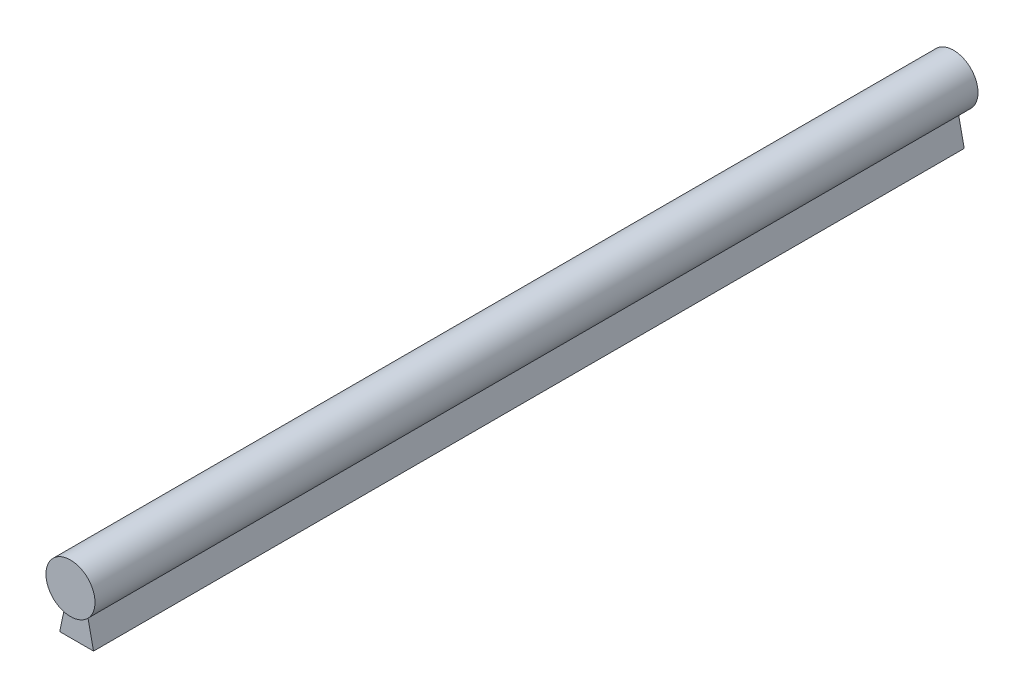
ISO-10303-21;
HEADER;
FILE_DESCRIPTION(('STEP AP214'),'2;1');
FILE_NAME('part.step','',(''),(''),'','','');
FILE_SCHEMA(('AUTOMOTIVE_DESIGN { 1 0 10303 214 1 1 1 1 }'));
ENDSEC;
DATA;
#1=APPLICATION_CONTEXT('core data for automotive mechanical design processes');
#2=APPLICATION_PROTOCOL_DEFINITION('international standard','automotive_design',2000,#1);
#3=PRODUCT_CONTEXT('',#1,'mechanical');
#4=PRODUCT('Part','Part','',(#3));
#5=PRODUCT_RELATED_PRODUCT_CATEGORY('part','',(#4));
#6=PRODUCT_DEFINITION_FORMATION('','',#4);
#7=PRODUCT_DEFINITION_CONTEXT('part definition',#1,'design');
#8=PRODUCT_DEFINITION('design','',#6,#7);
#9=PRODUCT_DEFINITION_SHAPE('','',#8);
#10=(LENGTH_UNIT() NAMED_UNIT(*) SI_UNIT(.MILLI.,.METRE.));
#11=(NAMED_UNIT(*) PLANE_ANGLE_UNIT() SI_UNIT($,.RADIAN.));
#12=(NAMED_UNIT(*) SI_UNIT($,.STERADIAN.) SOLID_ANGLE_UNIT());
#13=UNCERTAINTY_MEASURE_WITH_UNIT(LENGTH_MEASURE(1.E-05),#10,'distance_accuracy_value','');
#14=(GEOMETRIC_REPRESENTATION_CONTEXT(3) GLOBAL_UNCERTAINTY_ASSIGNED_CONTEXT((#13)) GLOBAL_UNIT_ASSIGNED_CONTEXT((#10,
#11,#12)) REPRESENTATION_CONTEXT('',''));
#15=CARTESIAN_POINT('',(0.,0.,0.));
#16=DIRECTION('',(0.,0.,1.));
#17=DIRECTION('',(1.,0.,0.));
#18=AXIS2_PLACEMENT_3D('',#15,#16,#17);
#19=CARTESIAN_POINT('',(0.,0.,457.2));
#20=DIRECTION('',(0.,0.,-1.));
#21=DIRECTION('',(-1.,0.,0.));
#22=AXIS2_PLACEMENT_3D('',#19,#20,#21);
#23=CYLINDRICAL_SURFACE('',#22,12.7);
#24=DIRECTION('',(0.,0.,-1.));
#25=VECTOR('',#24,1.);
#26=CARTESIAN_POINT('',(-5.76895260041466,-11.3141144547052,454.025));
#27=LINE('',#26,#25);
#28=CARTESIAN_POINT('',(-5.76895260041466,-11.3141144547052,454.025));
#29=VERTEX_POINT('',#28);
#30=CARTESIAN_POINT('',(-5.76895260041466,-11.3141144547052,3.17499999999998));
#31=VERTEX_POINT('',#30);
#32=EDGE_CURVE('E51',#29,#31,#27,.T.);
#33=ORIENTED_EDGE('',*,*,#32,.F.);
#34=CARTESIAN_POINT('',(0.,0.,454.025));
#35=DIRECTION('',(0.,0.,1.));
#36=DIRECTION('',(1.,0.,0.));
#37=AXIS2_PLACEMENT_3D('',#34,#35,#36);
#38=CIRCLE('',#37,12.7);
#39=CARTESIAN_POINT('',(5.76895260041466,-11.3141144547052,454.025));
#40=VERTEX_POINT('',#39);
#41=EDGE_CURVE('E46',#29,#40,#38,.T.);
#42=ORIENTED_EDGE('',*,*,#41,.T.);
#43=DIRECTION('',(0.,0.,-1.));
#44=VECTOR('',#43,1.);
#45=CARTESIAN_POINT('',(5.76895260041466,-11.3141144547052,454.025));
#46=LINE('',#45,#44);
#47=CARTESIAN_POINT('',(5.76895260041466,-11.3141144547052,3.175));
#48=VERTEX_POINT('',#47);
#49=EDGE_CURVE('E105',#40,#48,#46,.T.);
#50=ORIENTED_EDGE('',*,*,#49,.T.);
#51=CARTESIAN_POINT('',(0.,0.,3.175));
#52=DIRECTION('',(0.,0.,1.));
#53=DIRECTION('',(1.,0.,0.));
#54=AXIS2_PLACEMENT_3D('',#51,#52,#53);
#55=CIRCLE('',#54,12.7);
#56=EDGE_CURVE('E97',#31,#48,#55,.T.);
#57=ORIENTED_EDGE('',*,*,#56,.F.);
#58=EDGE_LOOP('',(#33,#42,#50,#57));
#59=FACE_BOUND('',#58,.T.);
#60=CARTESIAN_POINT('',(0.,0.,457.2));
#61=DIRECTION('',(0.,0.,1.));
#62=DIRECTION('',(1.,0.,0.));
#63=AXIS2_PLACEMENT_3D('',#60,#61,#62);
#64=CIRCLE('',#63,12.7);
#65=CARTESIAN_POINT('',(12.7,0.,457.2));
#66=VERTEX_POINT('',#65);
#67=EDGE_CURVE('E11',#66,#66,#64,.T.);
#68=ORIENTED_EDGE('',*,*,#67,.F.);
#69=EDGE_LOOP('',(#68));
#70=FACE_BOUND('',#69,.T.);
#71=CARTESIAN_POINT('',(0.,0.,0.));
#72=DIRECTION('',(0.,0.,1.));
#73=DIRECTION('',(1.,0.,0.));
#74=AXIS2_PLACEMENT_3D('',#71,#72,#73);
#75=CIRCLE('',#74,12.7);
#76=CARTESIAN_POINT('',(12.7,0.,0.));
#77=VERTEX_POINT('',#76);
#78=EDGE_CURVE('E35',#77,#77,#75,.T.);
#79=ORIENTED_EDGE('',*,*,#78,.T.);
#80=EDGE_LOOP('',(#79));
#81=FACE_BOUND('',#80,.T.);
#82=ADVANCED_FACE('F32',(#59,#70,#81),#23,.T.);
#83=CARTESIAN_POINT('',(0.,0.,457.2));
#84=DIRECTION('',(0.,0.,1.));
#85=DIRECTION('',(1.,0.,0.));
#86=AXIS2_PLACEMENT_3D('',#83,#84,#85);
#87=PLANE('',#86);
#88=ORIENTED_EDGE('',*,*,#67,.T.);
#89=EDGE_LOOP('',(#88));
#90=FACE_BOUND('',#89,.T.);
#91=ADVANCED_FACE('F114',(#90),#87,.T.);
#92=CARTESIAN_POINT('',(0.,0.,0.));
#93=DIRECTION('',(0.,0.,1.));
#94=DIRECTION('',(1.,0.,0.));
#95=AXIS2_PLACEMENT_3D('',#92,#93,#94);
#96=PLANE('',#95);
#97=ORIENTED_EDGE('',*,*,#78,.F.);
#98=EDGE_LOOP('',(#97));
#99=FACE_BOUND('',#98,.T.);
#100=ADVANCED_FACE('F111',(#99),#96,.F.);
#101=CARTESIAN_POINT('',(8.763,-25.4,454.025));
#102=DIRECTION('',(-0.978147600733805,-0.20791169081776,0.));
#103=DIRECTION('',(0.20791169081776,-0.978147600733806,0.));
#104=AXIS2_PLACEMENT_3D('',#101,#102,#103);
#105=PLANE('',#104);
#106=DIRECTION('',(-0.20791169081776,0.978147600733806,0.));
#107=VECTOR('',#106,1.);
#108=CARTESIAN_POINT('',(8.763,-25.4,3.175));
#109=LINE('',#108,#107);
#110=CARTESIAN_POINT('',(8.763,-25.4,3.175));
#111=VERTEX_POINT('',#110);
#112=EDGE_CURVE('E94',#111,#48,#109,.T.);
#113=ORIENTED_EDGE('',*,*,#112,.T.);
#114=ORIENTED_EDGE('',*,*,#49,.F.);
#115=DIRECTION('',(-0.20791169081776,0.978147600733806,0.));
#116=VECTOR('',#115,1.);
#117=CARTESIAN_POINT('',(8.763,-25.4,454.025));
#118=LINE('',#117,#116);
#119=CARTESIAN_POINT('',(8.763,-25.4,454.025));
#120=VERTEX_POINT('',#119);
#121=EDGE_CURVE('E90',#120,#40,#118,.T.);
#122=ORIENTED_EDGE('',*,*,#121,.F.);
#123=DIRECTION('',(0.,0.,-1.));
#124=VECTOR('',#123,1.);
#125=CARTESIAN_POINT('',(8.763,-25.4,454.025));
#126=LINE('',#125,#124);
#127=EDGE_CURVE('E79',#120,#111,#126,.T.);
#128=ORIENTED_EDGE('',*,*,#127,.T.);
#129=EDGE_LOOP('',(#113,#114,#122,#128));
#130=FACE_BOUND('',#129,.T.);
#131=ADVANCED_FACE('F113',(#130),#105,.F.);
#132=CARTESIAN_POINT('',(-8.763,-25.4,454.025));
#133=DIRECTION('',(-0.978147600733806,0.20791169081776,0.));
#134=DIRECTION('',(-0.20791169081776,-0.978147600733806,0.));
#135=AXIS2_PLACEMENT_3D('',#132,#133,#134);
#136=PLANE('',#135);
#137=DIRECTION('',(0.20791169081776,0.978147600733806,0.));
#138=VECTOR('',#137,1.);
#139=CARTESIAN_POINT('',(-8.763,-25.4,3.175));
#140=LINE('',#139,#138);
#141=CARTESIAN_POINT('',(-8.763,-25.4,3.175));
#142=VERTEX_POINT('',#141);
#143=EDGE_CURVE('E76',#142,#31,#140,.T.);
#144=ORIENTED_EDGE('',*,*,#143,.F.);
#145=DIRECTION('',(0.,0.,-1.));
#146=VECTOR('',#145,1.);
#147=CARTESIAN_POINT('',(-8.763,-25.4,454.025));
#148=LINE('',#147,#146);
#149=CARTESIAN_POINT('',(-8.763,-25.4,454.025));
#150=VERTEX_POINT('',#149);
#151=EDGE_CURVE('E70',#150,#142,#148,.T.);
#152=ORIENTED_EDGE('',*,*,#151,.F.);
#153=DIRECTION('',(0.20791169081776,0.978147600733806,0.));
#154=VECTOR('',#153,1.);
#155=CARTESIAN_POINT('',(-8.763,-25.4,454.025));
#156=LINE('',#155,#154);
#157=EDGE_CURVE('E74',#150,#29,#156,.T.);
#158=ORIENTED_EDGE('',*,*,#157,.T.);
#159=ORIENTED_EDGE('',*,*,#32,.T.);
#160=EDGE_LOOP('',(#144,#152,#158,#159));
#161=FACE_BOUND('',#160,.T.);
#162=ADVANCED_FACE('F72',(#161),#136,.T.);
#163=CARTESIAN_POINT('',(-8.763,-25.4,454.025));
#164=DIRECTION('',(0.,1.,0.));
#165=DIRECTION('',(-1.,0.,0.));
#166=AXIS2_PLACEMENT_3D('',#163,#164,#165);
#167=PLANE('',#166);
#168=DIRECTION('',(1.,0.,0.));
#169=VECTOR('',#168,1.);
#170=CARTESIAN_POINT('',(-8.763,-25.4,3.175));
#171=LINE('',#170,#169);
#172=EDGE_CURVE('E101',#142,#111,#171,.T.);
#173=ORIENTED_EDGE('',*,*,#172,.T.);
#174=ORIENTED_EDGE('',*,*,#127,.F.);
#175=DIRECTION('',(1.,0.,0.));
#176=VECTOR('',#175,1.);
#177=CARTESIAN_POINT('',(-8.763,-25.4,454.025));
#178=LINE('',#177,#176);
#179=EDGE_CURVE('E82',#150,#120,#178,.T.);
#180=ORIENTED_EDGE('',*,*,#179,.F.);
#181=ORIENTED_EDGE('',*,*,#151,.T.);
#182=EDGE_LOOP('',(#173,#174,#180,#181));
#183=FACE_BOUND('',#182,.T.);
#184=ADVANCED_FACE('F83',(#183),#167,.F.);
#185=CARTESIAN_POINT('',(0.,0.,454.025));
#186=DIRECTION('',(0.,0.,1.));
#187=DIRECTION('',(1.,0.,0.));
#188=AXIS2_PLACEMENT_3D('',#185,#186,#187);
#189=PLANE('',#188);
#190=ORIENTED_EDGE('',*,*,#121,.T.);
#191=ORIENTED_EDGE('',*,*,#41,.F.);
#192=ORIENTED_EDGE('',*,*,#157,.F.);
#193=ORIENTED_EDGE('',*,*,#179,.T.);
#194=EDGE_LOOP('',(#190,#191,#192,#193));
#195=FACE_BOUND('',#194,.T.);
#196=ADVANCED_FACE('F88',(#195),#189,.T.);
#197=CARTESIAN_POINT('',(0.,0.,3.175));
#198=DIRECTION('',(0.,0.,1.));
#199=DIRECTION('',(1.,0.,0.));
#200=AXIS2_PLACEMENT_3D('',#197,#198,#199);
#201=PLANE('',#200);
#202=ORIENTED_EDGE('',*,*,#112,.F.);
#203=ORIENTED_EDGE('',*,*,#172,.F.);
#204=ORIENTED_EDGE('',*,*,#143,.T.);
#205=ORIENTED_EDGE('',*,*,#56,.T.);
#206=EDGE_LOOP('',(#202,#203,#204,#205));
#207=FACE_BOUND('',#206,.T.);
#208=ADVANCED_FACE('F165',(#207),#201,.F.);
#209=CLOSED_SHELL('',(#82,#91,#100,#131,#162,#184,#196,#208));
#210=MANIFOLD_SOLID_BREP('B2',#209);
#211=ADVANCED_BREP_SHAPE_REPRESENTATION('',(#18,#210),#14);
#212=SHAPE_DEFINITION_REPRESENTATION(#9,#211);
ENDSEC;
END-ISO-10303-21;
